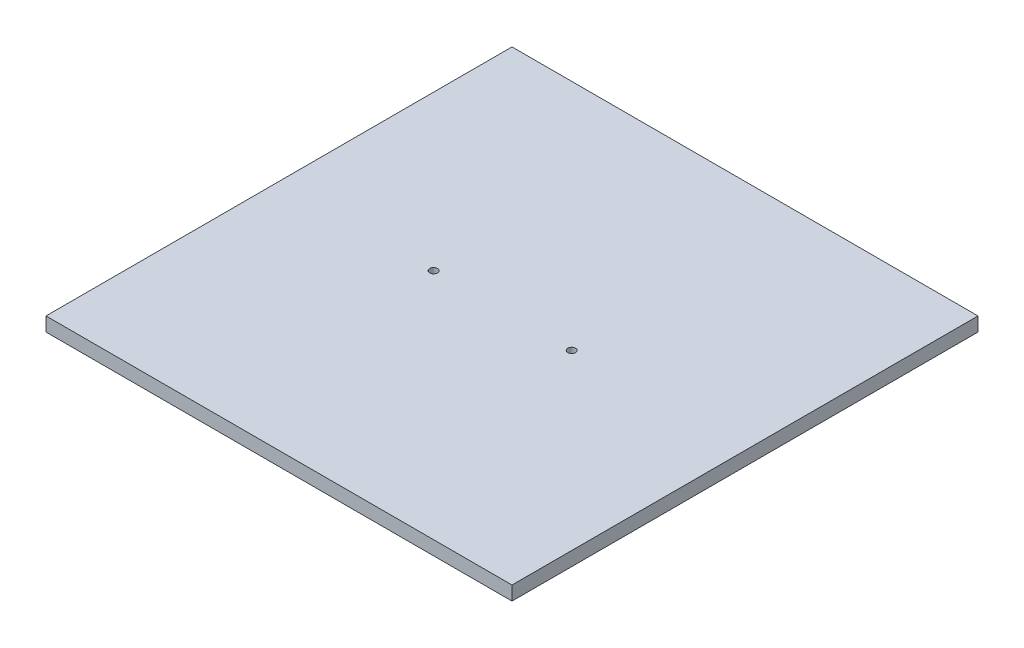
ISO-10303-21;
HEADER;
FILE_DESCRIPTION(('STEP AP214'),'2;1');
FILE_NAME('part.step','',(''),(''),'','','');
FILE_SCHEMA(('AUTOMOTIVE_DESIGN { 1 0 10303 214 1 1 1 1 }'));
ENDSEC;
DATA;
#1=APPLICATION_CONTEXT('core data for automotive mechanical design processes');
#2=APPLICATION_PROTOCOL_DEFINITION('international standard','automotive_design',2000,#1);
#3=PRODUCT_CONTEXT('',#1,'mechanical');
#4=PRODUCT('Part','Part','',(#3));
#5=PRODUCT_RELATED_PRODUCT_CATEGORY('part','',(#4));
#6=PRODUCT_DEFINITION_FORMATION('','',#4);
#7=PRODUCT_DEFINITION_CONTEXT('part definition',#1,'design');
#8=PRODUCT_DEFINITION('design','',#6,#7);
#9=PRODUCT_DEFINITION_SHAPE('','',#8);
#10=(LENGTH_UNIT() NAMED_UNIT(*) SI_UNIT(.MILLI.,.METRE.));
#11=(NAMED_UNIT(*) PLANE_ANGLE_UNIT() SI_UNIT($,.RADIAN.));
#12=(NAMED_UNIT(*) SI_UNIT($,.STERADIAN.) SOLID_ANGLE_UNIT());
#13=UNCERTAINTY_MEASURE_WITH_UNIT(LENGTH_MEASURE(1.E-05),#10,'distance_accuracy_value','');
#14=(GEOMETRIC_REPRESENTATION_CONTEXT(3) GLOBAL_UNCERTAINTY_ASSIGNED_CONTEXT((#13)) GLOBAL_UNIT_ASSIGNED_CONTEXT((#10,
#11,#12)) REPRESENTATION_CONTEXT('',''));
#15=CARTESIAN_POINT('',(0.,0.,0.));
#16=DIRECTION('',(0.,0.,1.));
#17=DIRECTION('',(1.,0.,0.));
#18=AXIS2_PLACEMENT_3D('',#15,#16,#17);
#19=CARTESIAN_POINT('',(0.,9.,0.));
#20=DIRECTION('',(0.,-1.,0.));
#21=DIRECTION('',(0.,0.,-1.));
#22=AXIS2_PLACEMENT_3D('',#19,#20,#21);
#23=PLANE('',#22);
#24=DIRECTION('',(0.,0.,1.));
#25=VECTOR('',#24,1.);
#26=CARTESIAN_POINT('',(0.,9.,0.));
#27=LINE('',#26,#25);
#28=CARTESIAN_POINT('',(0.,9.,-300.));
#29=VERTEX_POINT('',#28);
#30=CARTESIAN_POINT('',(0.,9.,0.));
#31=VERTEX_POINT('',#30);
#32=EDGE_CURVE('E91',#29,#31,#27,.T.);
#33=ORIENTED_EDGE('',*,*,#32,.T.);
#34=DIRECTION('',(1.,0.,0.));
#35=VECTOR('',#34,1.);
#36=CARTESIAN_POINT('',(0.,9.,0.));
#37=LINE('',#36,#35);
#38=CARTESIAN_POINT('',(300.,9.,0.));
#39=VERTEX_POINT('',#38);
#40=EDGE_CURVE('E86',#31,#39,#37,.T.);
#41=ORIENTED_EDGE('',*,*,#40,.T.);
#42=DIRECTION('',(0.,0.,-1.));
#43=VECTOR('',#42,1.);
#44=CARTESIAN_POINT('',(300.,9.,0.));
#45=LINE('',#44,#43);
#46=CARTESIAN_POINT('',(300.,9.,-300.));
#47=VERTEX_POINT('',#46);
#48=EDGE_CURVE('E89',#39,#47,#45,.T.);
#49=ORIENTED_EDGE('',*,*,#48,.T.);
#50=DIRECTION('',(-1.,0.,0.));
#51=VECTOR('',#50,1.);
#52=CARTESIAN_POINT('',(0.,9.,-300.));
#53=LINE('',#52,#51);
#54=EDGE_CURVE('E56',#47,#29,#53,.T.);
#55=ORIENTED_EDGE('',*,*,#54,.T.);
#56=EDGE_LOOP('',(#33,#41,#49,#55));
#57=FACE_BOUND('',#56,.T.);
#58=CARTESIAN_POINT('',(99.56,9.,-150.));
#59=DIRECTION('',(0.,1.,0.));
#60=DIRECTION('',(0.,0.,1.));
#61=AXIS2_PLACEMENT_3D('',#58,#59,#60);
#62=CIRCLE('',#61,2.5);
#63=CARTESIAN_POINT('',(99.56,9.,-147.5));
#64=VERTEX_POINT('',#63);
#65=EDGE_CURVE('E106',#64,#64,#62,.T.);
#66=ORIENTED_EDGE('',*,*,#65,.F.);
#67=EDGE_LOOP('',(#66));
#68=FACE_BOUND('',#67,.T.);
#69=CARTESIAN_POINT('',(188.44,9.,-150.));
#70=DIRECTION('',(0.,1.,0.));
#71=DIRECTION('',(0.,0.,1.));
#72=AXIS2_PLACEMENT_3D('',#69,#70,#71);
#73=CIRCLE('',#72,2.5);
#74=CARTESIAN_POINT('',(188.44,9.,-147.5));
#75=VERTEX_POINT('',#74);
#76=EDGE_CURVE('E121',#75,#75,#73,.T.);
#77=ORIENTED_EDGE('',*,*,#76,.F.);
#78=EDGE_LOOP('',(#77));
#79=FACE_BOUND('',#78,.T.);
#80=ADVANCED_FACE('F39',(#57,#68,#79),#23,.F.);
#81=CARTESIAN_POINT('',(0.,0.,0.));
#82=DIRECTION('',(0.,-1.,0.));
#83=DIRECTION('',(0.,0.,-1.));
#84=AXIS2_PLACEMENT_3D('',#81,#82,#83);
#85=PLANE('',#84);
#86=CARTESIAN_POINT('',(99.56,0.,-150.));
#87=DIRECTION('',(0.,1.,0.));
#88=DIRECTION('',(0.,0.,1.));
#89=AXIS2_PLACEMENT_3D('',#86,#87,#88);
#90=CIRCLE('',#89,2.5);
#91=CARTESIAN_POINT('',(99.56,0.,-147.5));
#92=VERTEX_POINT('',#91);
#93=EDGE_CURVE('E118',#92,#92,#90,.T.);
#94=ORIENTED_EDGE('',*,*,#93,.T.);
#95=EDGE_LOOP('',(#94));
#96=FACE_BOUND('',#95,.T.);
#97=DIRECTION('',(0.,0.,1.));
#98=VECTOR('',#97,1.);
#99=CARTESIAN_POINT('',(0.,0.,0.));
#100=LINE('',#99,#98);
#101=CARTESIAN_POINT('',(0.,0.,-300.));
#102=VERTEX_POINT('',#101);
#103=CARTESIAN_POINT('',(0.,0.,0.));
#104=VERTEX_POINT('',#103);
#105=EDGE_CURVE('E103',#102,#104,#100,.T.);
#106=ORIENTED_EDGE('',*,*,#105,.F.);
#107=DIRECTION('',(-1.,0.,0.));
#108=VECTOR('',#107,1.);
#109=CARTESIAN_POINT('',(0.,0.,-300.));
#110=LINE('',#109,#108);
#111=CARTESIAN_POINT('',(300.,0.,-300.));
#112=VERTEX_POINT('',#111);
#113=EDGE_CURVE('E79',#112,#102,#110,.T.);
#114=ORIENTED_EDGE('',*,*,#113,.F.);
#115=DIRECTION('',(0.,0.,-1.));
#116=VECTOR('',#115,1.);
#117=CARTESIAN_POINT('',(300.,0.,0.));
#118=LINE('',#117,#116);
#119=CARTESIAN_POINT('',(300.,0.,0.));
#120=VERTEX_POINT('',#119);
#121=EDGE_CURVE('E73',#120,#112,#118,.T.);
#122=ORIENTED_EDGE('',*,*,#121,.F.);
#123=DIRECTION('',(1.,0.,0.));
#124=VECTOR('',#123,1.);
#125=CARTESIAN_POINT('',(0.,0.,0.));
#126=LINE('',#125,#124);
#127=EDGE_CURVE('E95',#104,#120,#126,.T.);
#128=ORIENTED_EDGE('',*,*,#127,.F.);
#129=EDGE_LOOP('',(#106,#114,#122,#128));
#130=FACE_BOUND('',#129,.T.);
#131=CARTESIAN_POINT('',(188.44,0.,-150.));
#132=DIRECTION('',(0.,1.,0.));
#133=DIRECTION('',(0.,0.,1.));
#134=AXIS2_PLACEMENT_3D('',#131,#132,#133);
#135=CIRCLE('',#134,2.5);
#136=CARTESIAN_POINT('',(188.44,0.,-147.5));
#137=VERTEX_POINT('',#136);
#138=EDGE_CURVE('E124',#137,#137,#135,.T.);
#139=ORIENTED_EDGE('',*,*,#138,.T.);
#140=EDGE_LOOP('',(#139));
#141=FACE_BOUND('',#140,.T.);
#142=ADVANCED_FACE('F114',(#96,#130,#141),#85,.T.);
#143=CARTESIAN_POINT('',(0.,9.,0.));
#144=DIRECTION('',(1.,0.,0.));
#145=DIRECTION('',(0.,0.,-1.));
#146=AXIS2_PLACEMENT_3D('',#143,#144,#145);
#147=PLANE('',#146);
#148=ORIENTED_EDGE('',*,*,#105,.T.);
#149=DIRECTION('',(0.,-1.,0.));
#150=VECTOR('',#149,1.);
#151=CARTESIAN_POINT('',(0.,9.,0.));
#152=LINE('',#151,#150);
#153=EDGE_CURVE('E11',#31,#104,#152,.T.);
#154=ORIENTED_EDGE('',*,*,#153,.F.);
#155=ORIENTED_EDGE('',*,*,#32,.F.);
#156=DIRECTION('',(0.,-1.,0.));
#157=VECTOR('',#156,1.);
#158=CARTESIAN_POINT('',(0.,9.,-300.));
#159=LINE('',#158,#157);
#160=EDGE_CURVE('E99',#29,#102,#159,.T.);
#161=ORIENTED_EDGE('',*,*,#160,.T.);
#162=EDGE_LOOP('',(#148,#154,#155,#161));
#163=FACE_BOUND('',#162,.T.);
#164=ADVANCED_FACE('F41',(#163),#147,.F.);
#165=CARTESIAN_POINT('',(0.,9.,0.));
#166=DIRECTION('',(0.,0.,-1.));
#167=DIRECTION('',(-1.,0.,0.));
#168=AXIS2_PLACEMENT_3D('',#165,#166,#167);
#169=PLANE('',#168);
#170=ORIENTED_EDGE('',*,*,#127,.T.);
#171=DIRECTION('',(0.,-1.,0.));
#172=VECTOR('',#171,1.);
#173=CARTESIAN_POINT('',(300.,9.,0.));
#174=LINE('',#173,#172);
#175=EDGE_CURVE('E48',#39,#120,#174,.T.);
#176=ORIENTED_EDGE('',*,*,#175,.F.);
#177=ORIENTED_EDGE('',*,*,#40,.F.);
#178=ORIENTED_EDGE('',*,*,#153,.T.);
#179=EDGE_LOOP('',(#170,#176,#177,#178));
#180=FACE_BOUND('',#179,.T.);
#181=ADVANCED_FACE('F94',(#180),#169,.F.);
#182=CARTESIAN_POINT('',(300.,9.,0.));
#183=DIRECTION('',(-1.,0.,0.));
#184=DIRECTION('',(0.,0.,1.));
#185=AXIS2_PLACEMENT_3D('',#182,#183,#184);
#186=PLANE('',#185);
#187=ORIENTED_EDGE('',*,*,#121,.T.);
#188=DIRECTION('',(0.,-1.,0.));
#189=VECTOR('',#188,1.);
#190=CARTESIAN_POINT('',(300.,9.,-300.));
#191=LINE('',#190,#189);
#192=EDGE_CURVE('E96',#47,#112,#191,.T.);
#193=ORIENTED_EDGE('',*,*,#192,.F.);
#194=ORIENTED_EDGE('',*,*,#48,.F.);
#195=ORIENTED_EDGE('',*,*,#175,.T.);
#196=EDGE_LOOP('',(#187,#193,#194,#195));
#197=FACE_BOUND('',#196,.T.);
#198=ADVANCED_FACE('F97',(#197),#186,.F.);
#199=CARTESIAN_POINT('',(0.,9.,-300.));
#200=DIRECTION('',(0.,0.,1.));
#201=DIRECTION('',(1.,0.,0.));
#202=AXIS2_PLACEMENT_3D('',#199,#200,#201);
#203=PLANE('',#202);
#204=ORIENTED_EDGE('',*,*,#113,.T.);
#205=ORIENTED_EDGE('',*,*,#160,.F.);
#206=ORIENTED_EDGE('',*,*,#54,.F.);
#207=ORIENTED_EDGE('',*,*,#192,.T.);
#208=EDGE_LOOP('',(#204,#205,#206,#207));
#209=FACE_BOUND('',#208,.T.);
#210=ADVANCED_FACE('F111',(#209),#203,.F.);
#211=CARTESIAN_POINT('',(99.56,9.,-150.));
#212=DIRECTION('',(0.,-1.,0.));
#213=DIRECTION('',(0.,0.,-1.));
#214=AXIS2_PLACEMENT_3D('',#211,#212,#213);
#215=CYLINDRICAL_SURFACE('',#214,2.5);
#216=ORIENTED_EDGE('',*,*,#65,.T.);
#217=EDGE_LOOP('',(#216));
#218=FACE_BOUND('',#217,.T.);
#219=ORIENTED_EDGE('',*,*,#93,.F.);
#220=EDGE_LOOP('',(#219));
#221=FACE_BOUND('',#220,.T.);
#222=ADVANCED_FACE('F141',(#218,#221),#215,.F.);
#223=CARTESIAN_POINT('',(188.44,9.,-150.));
#224=DIRECTION('',(0.,-1.,0.));
#225=DIRECTION('',(0.,0.,-1.));
#226=AXIS2_PLACEMENT_3D('',#223,#224,#225);
#227=CYLINDRICAL_SURFACE('',#226,2.5);
#228=ORIENTED_EDGE('',*,*,#76,.T.);
#229=EDGE_LOOP('',(#228));
#230=FACE_BOUND('',#229,.T.);
#231=ORIENTED_EDGE('',*,*,#138,.F.);
#232=EDGE_LOOP('',(#231));
#233=FACE_BOUND('',#232,.T.);
#234=ADVANCED_FACE('F130',(#230,#233),#227,.F.);
#235=CLOSED_SHELL('',(#80,#142,#164,#181,#198,#210,#222,#234));
#236=MANIFOLD_SOLID_BREP('B2',#235);
#237=ADVANCED_BREP_SHAPE_REPRESENTATION('',(#18,#236),#14);
#238=SHAPE_DEFINITION_REPRESENTATION(#9,#237);
ENDSEC;
END-ISO-10303-21;
